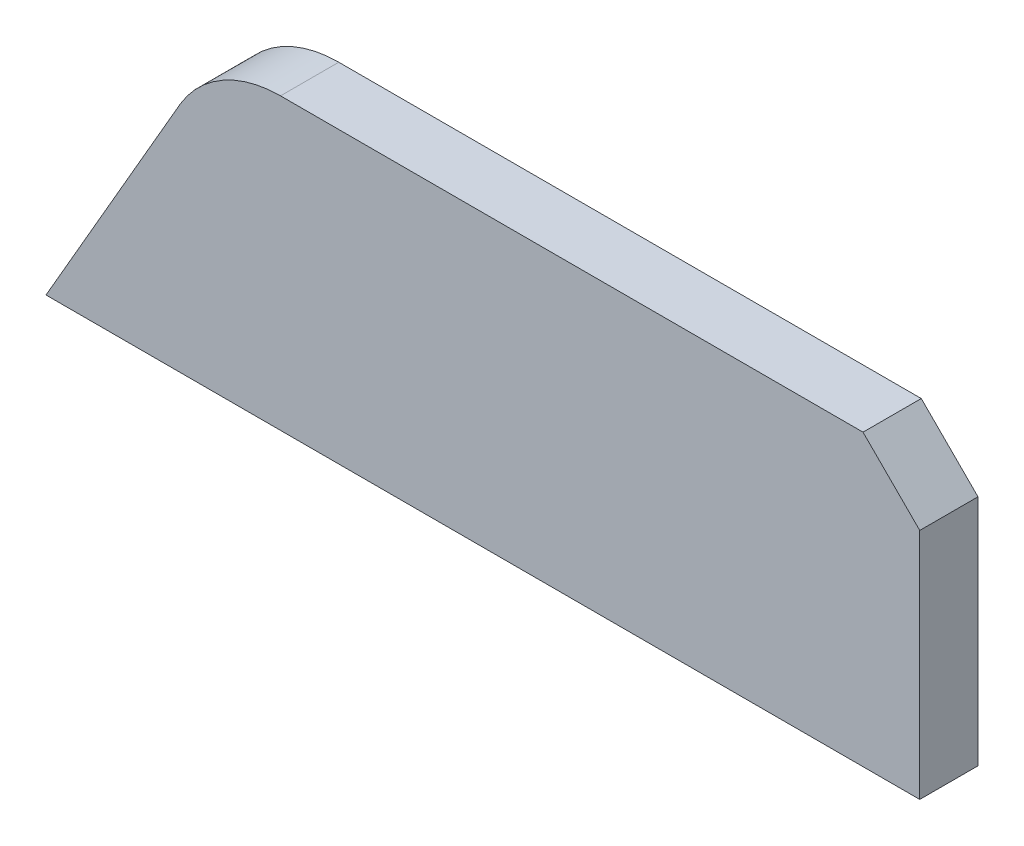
from build123d import *

# Parameters (mm, degrees)
BOSS_EXTRUDE1_DEPTH = 10


with BuildPart() as part:
    # Sketch3 → Boss-Extrude1 (new body)
    with BuildSketch(Plane.XY):
        with BuildLine():
            Line((0, 0), (0, 40))
            Line((0, 40), (-9.738884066, 49.738884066))
            Line((-9.738884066, 49.738884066), (-109.738884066, 49.738884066))
            ThreePointArc((-109.738884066, 49.738884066), (-119.607462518, 47.13460651), (-126.905989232, 40))
            Line((-126.905989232, 40), (-150, 0))
            Line((-150, 0), (0, 0))
        make_face()
    extrude(amount=BOSS_EXTRUDE1_DEPTH)


solid = part.part
